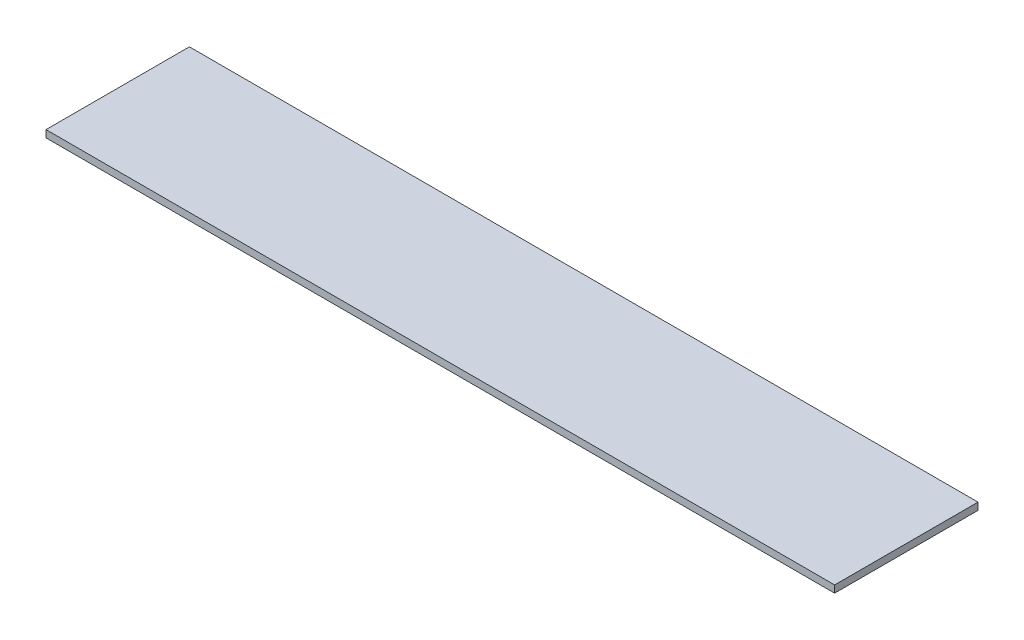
ISO-10303-21;
HEADER;
FILE_DESCRIPTION(('STEP AP214'),'2;1');
FILE_NAME('part.step','',(''),(''),'','','');
FILE_SCHEMA(('AUTOMOTIVE_DESIGN { 1 0 10303 214 1 1 1 1 }'));
ENDSEC;
DATA;
#1=APPLICATION_CONTEXT('core data for automotive mechanical design processes');
#2=APPLICATION_PROTOCOL_DEFINITION('international standard','automotive_design',2000,#1);
#3=PRODUCT_CONTEXT('',#1,'mechanical');
#4=PRODUCT('Part','Part','',(#3));
#5=PRODUCT_RELATED_PRODUCT_CATEGORY('part','',(#4));
#6=PRODUCT_DEFINITION_FORMATION('','',#4);
#7=PRODUCT_DEFINITION_CONTEXT('part definition',#1,'design');
#8=PRODUCT_DEFINITION('design','',#6,#7);
#9=PRODUCT_DEFINITION_SHAPE('','',#8);
#10=(LENGTH_UNIT() NAMED_UNIT(*) SI_UNIT(.MILLI.,.METRE.));
#11=(NAMED_UNIT(*) PLANE_ANGLE_UNIT() SI_UNIT($,.RADIAN.));
#12=(NAMED_UNIT(*) SI_UNIT($,.STERADIAN.) SOLID_ANGLE_UNIT());
#13=UNCERTAINTY_MEASURE_WITH_UNIT(LENGTH_MEASURE(1.E-05),#10,'distance_accuracy_value','');
#14=(GEOMETRIC_REPRESENTATION_CONTEXT(3) GLOBAL_UNCERTAINTY_ASSIGNED_CONTEXT((#13)) GLOBAL_UNIT_ASSIGNED_CONTEXT((#10,
#11,#12)) REPRESENTATION_CONTEXT('',''));
#15=CARTESIAN_POINT('',(0.,0.,0.));
#16=DIRECTION('',(0.,0.,1.));
#17=DIRECTION('',(1.,0.,0.));
#18=AXIS2_PLACEMENT_3D('',#15,#16,#17);
#19=CARTESIAN_POINT('',(-275.,-5.,-50.));
#20=DIRECTION('',(-1.,0.,0.));
#21=DIRECTION('',(0.,0.,1.));
#22=AXIS2_PLACEMENT_3D('',#19,#20,#21);
#23=PLANE('',#22);
#24=DIRECTION('',(0.,0.,1.));
#25=VECTOR('',#24,1.);
#26=CARTESIAN_POINT('',(-275.,0.,-50.));
#27=LINE('',#26,#25);
#28=CARTESIAN_POINT('',(-275.,0.,-50.));
#29=VERTEX_POINT('',#28);
#30=CARTESIAN_POINT('',(-275.,0.,50.));
#31=VERTEX_POINT('',#30);
#32=EDGE_CURVE('E97',#29,#31,#27,.T.);
#33=ORIENTED_EDGE('',*,*,#32,.F.);
#34=DIRECTION('',(0.,1.,0.));
#35=VECTOR('',#34,1.);
#36=CARTESIAN_POINT('',(-275.,-5.,-50.));
#37=LINE('',#36,#35);
#38=CARTESIAN_POINT('',(-275.,-5.,-50.));
#39=VERTEX_POINT('',#38);
#40=EDGE_CURVE('E11',#39,#29,#37,.T.);
#41=ORIENTED_EDGE('',*,*,#40,.F.);
#42=DIRECTION('',(0.,0.,1.));
#43=VECTOR('',#42,1.);
#44=CARTESIAN_POINT('',(-275.,-5.,-50.));
#45=LINE('',#44,#43);
#46=CARTESIAN_POINT('',(-275.,-5.,50.));
#47=VERTEX_POINT('',#46);
#48=EDGE_CURVE('E91',#39,#47,#45,.T.);
#49=ORIENTED_EDGE('',*,*,#48,.T.);
#50=DIRECTION('',(0.,1.,0.));
#51=VECTOR('',#50,1.);
#52=CARTESIAN_POINT('',(-275.,-5.,50.));
#53=LINE('',#52,#51);
#54=EDGE_CURVE('E36',#47,#31,#53,.T.);
#55=ORIENTED_EDGE('',*,*,#54,.T.);
#56=EDGE_LOOP('',(#33,#41,#49,#55));
#57=FACE_BOUND('',#56,.T.);
#58=ADVANCED_FACE('F33',(#57),#23,.T.);
#59=CARTESIAN_POINT('',(-275.,-5.,-50.));
#60=DIRECTION('',(0.,0.,-1.));
#61=DIRECTION('',(-1.,0.,0.));
#62=AXIS2_PLACEMENT_3D('',#59,#60,#61);
#63=PLANE('',#62);
#64=DIRECTION('',(-1.,0.,0.));
#65=VECTOR('',#64,1.);
#66=CARTESIAN_POINT('',(-275.,0.,-50.));
#67=LINE('',#66,#65);
#68=CARTESIAN_POINT('',(275.,0.,-50.));
#69=VERTEX_POINT('',#68);
#70=EDGE_CURVE('E93',#69,#29,#67,.T.);
#71=ORIENTED_EDGE('',*,*,#70,.F.);
#72=DIRECTION('',(0.,1.,0.));
#73=VECTOR('',#72,1.);
#74=CARTESIAN_POINT('',(275.,-5.,-50.));
#75=LINE('',#74,#73);
#76=CARTESIAN_POINT('',(275.,-5.,-50.));
#77=VERTEX_POINT('',#76);
#78=EDGE_CURVE('E42',#77,#69,#75,.T.);
#79=ORIENTED_EDGE('',*,*,#78,.F.);
#80=DIRECTION('',(-1.,0.,0.));
#81=VECTOR('',#80,1.);
#82=CARTESIAN_POINT('',(-275.,-5.,-50.));
#83=LINE('',#82,#81);
#84=EDGE_CURVE('E88',#77,#39,#83,.T.);
#85=ORIENTED_EDGE('',*,*,#84,.T.);
#86=ORIENTED_EDGE('',*,*,#40,.T.);
#87=EDGE_LOOP('',(#71,#79,#85,#86));
#88=FACE_BOUND('',#87,.T.);
#89=ADVANCED_FACE('F107',(#88),#63,.T.);
#90=CARTESIAN_POINT('',(275.,-5.,-50.));
#91=DIRECTION('',(1.,0.,0.));
#92=DIRECTION('',(0.,0.,-1.));
#93=AXIS2_PLACEMENT_3D('',#90,#91,#92);
#94=PLANE('',#93);
#95=DIRECTION('',(0.,0.,-1.));
#96=VECTOR('',#95,1.);
#97=CARTESIAN_POINT('',(275.,0.,-50.));
#98=LINE('',#97,#96);
#99=CARTESIAN_POINT('',(275.,0.,50.));
#100=VERTEX_POINT('',#99);
#101=EDGE_CURVE('E83',#100,#69,#98,.T.);
#102=ORIENTED_EDGE('',*,*,#101,.F.);
#103=DIRECTION('',(0.,1.,0.));
#104=VECTOR('',#103,1.);
#105=CARTESIAN_POINT('',(275.,-5.,50.));
#106=LINE('',#105,#104);
#107=CARTESIAN_POINT('',(275.,-5.,50.));
#108=VERTEX_POINT('',#107);
#109=EDGE_CURVE('E78',#108,#100,#106,.T.);
#110=ORIENTED_EDGE('',*,*,#109,.F.);
#111=DIRECTION('',(0.,0.,-1.));
#112=VECTOR('',#111,1.);
#113=CARTESIAN_POINT('',(275.,-5.,-50.));
#114=LINE('',#113,#112);
#115=EDGE_CURVE('E81',#108,#77,#114,.T.);
#116=ORIENTED_EDGE('',*,*,#115,.T.);
#117=ORIENTED_EDGE('',*,*,#78,.T.);
#118=EDGE_LOOP('',(#102,#110,#116,#117));
#119=FACE_BOUND('',#118,.T.);
#120=ADVANCED_FACE('F80',(#119),#94,.T.);
#121=CARTESIAN_POINT('',(-275.,-5.,50.));
#122=DIRECTION('',(0.,0.,1.));
#123=DIRECTION('',(1.,0.,0.));
#124=AXIS2_PLACEMENT_3D('',#121,#122,#123);
#125=PLANE('',#124);
#126=DIRECTION('',(1.,0.,0.));
#127=VECTOR('',#126,1.);
#128=CARTESIAN_POINT('',(-275.,0.,50.));
#129=LINE('',#128,#127);
#130=EDGE_CURVE('E100',#31,#100,#129,.T.);
#131=ORIENTED_EDGE('',*,*,#130,.F.);
#132=ORIENTED_EDGE('',*,*,#54,.F.);
#133=DIRECTION('',(1.,0.,0.));
#134=VECTOR('',#133,1.);
#135=CARTESIAN_POINT('',(-275.,-5.,50.));
#136=LINE('',#135,#134);
#137=EDGE_CURVE('E87',#47,#108,#136,.T.);
#138=ORIENTED_EDGE('',*,*,#137,.T.);
#139=ORIENTED_EDGE('',*,*,#109,.T.);
#140=EDGE_LOOP('',(#131,#132,#138,#139));
#141=FACE_BOUND('',#140,.T.);
#142=ADVANCED_FACE('F90',(#141),#125,.T.);
#143=CARTESIAN_POINT('',(-275.,-5.,50.));
#144=DIRECTION('',(0.,1.,0.));
#145=DIRECTION('',(0.,0.,1.));
#146=AXIS2_PLACEMENT_3D('',#143,#144,#145);
#147=PLANE('',#146);
#148=ORIENTED_EDGE('',*,*,#48,.F.);
#149=ORIENTED_EDGE('',*,*,#84,.F.);
#150=ORIENTED_EDGE('',*,*,#115,.F.);
#151=ORIENTED_EDGE('',*,*,#137,.F.);
#152=EDGE_LOOP('',(#148,#149,#150,#151));
#153=FACE_BOUND('',#152,.T.);
#154=ADVANCED_FACE('F86',(#153),#147,.F.);
#155=CARTESIAN_POINT('',(-275.,0.,50.));
#156=DIRECTION('',(0.,1.,0.));
#157=DIRECTION('',(0.,0.,1.));
#158=AXIS2_PLACEMENT_3D('',#155,#156,#157);
#159=PLANE('',#158);
#160=ORIENTED_EDGE('',*,*,#32,.T.);
#161=ORIENTED_EDGE('',*,*,#130,.T.);
#162=ORIENTED_EDGE('',*,*,#101,.T.);
#163=ORIENTED_EDGE('',*,*,#70,.T.);
#164=EDGE_LOOP('',(#160,#161,#162,#163));
#165=FACE_BOUND('',#164,.T.);
#166=ADVANCED_FACE('F106',(#165),#159,.T.);
#167=CLOSED_SHELL('',(#58,#89,#120,#142,#154,#166));
#168=MANIFOLD_SOLID_BREP('B2',#167);
#169=ADVANCED_BREP_SHAPE_REPRESENTATION('',(#18,#168),#14);
#170=SHAPE_DEFINITION_REPRESENTATION(#9,#169);
ENDSEC;
END-ISO-10303-21;
